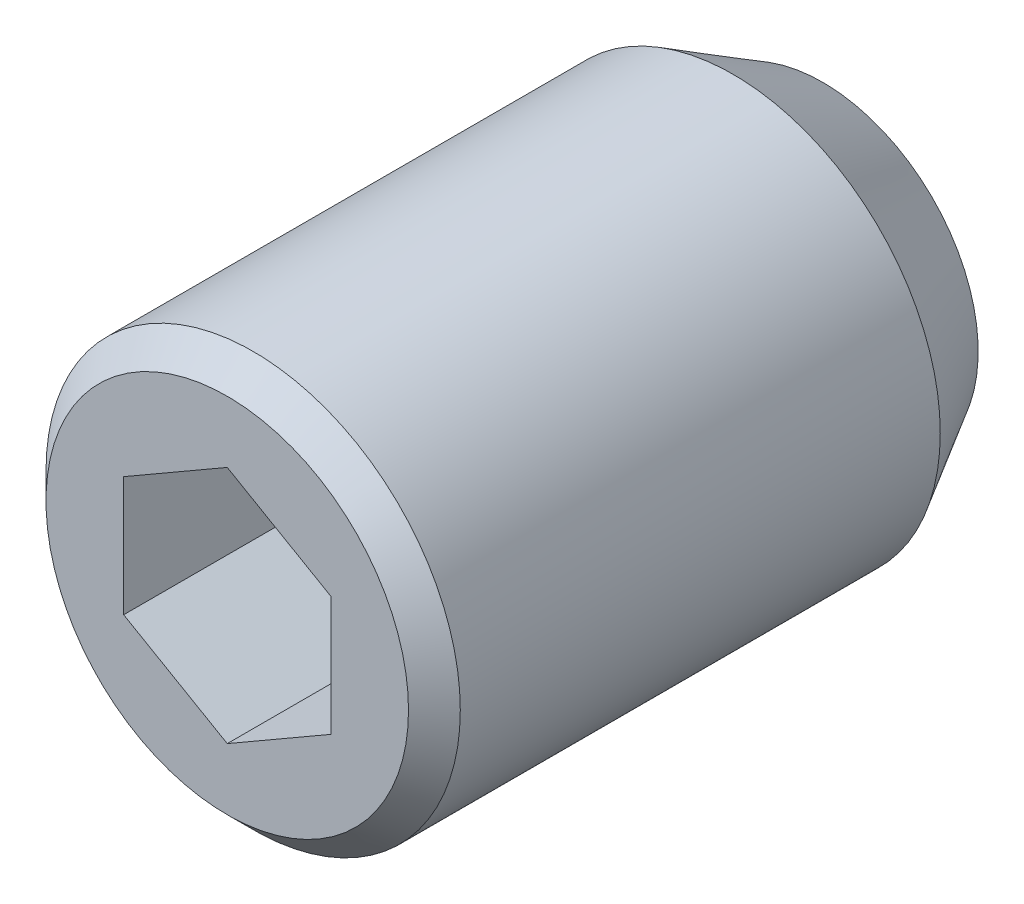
ISO-10303-21;
HEADER;
FILE_DESCRIPTION(('STEP AP214'),'2;1');
FILE_NAME('part.step','',(''),(''),'','','');
FILE_SCHEMA(('AUTOMOTIVE_DESIGN { 1 0 10303 214 1 1 1 1 }'));
ENDSEC;
DATA;
#1=APPLICATION_CONTEXT('core data for automotive mechanical design processes');
#2=APPLICATION_PROTOCOL_DEFINITION('international standard','automotive_design',2000,#1);
#3=PRODUCT_CONTEXT('',#1,'mechanical');
#4=PRODUCT('Part','Part','',(#3));
#5=PRODUCT_RELATED_PRODUCT_CATEGORY('part','',(#4));
#6=PRODUCT_DEFINITION_FORMATION('','',#4);
#7=PRODUCT_DEFINITION_CONTEXT('part definition',#1,'design');
#8=PRODUCT_DEFINITION('design','',#6,#7);
#9=PRODUCT_DEFINITION_SHAPE('','',#8);
#10=(LENGTH_UNIT() NAMED_UNIT(*) SI_UNIT(.MILLI.,.METRE.));
#11=(NAMED_UNIT(*) PLANE_ANGLE_UNIT() SI_UNIT($,.RADIAN.));
#12=(NAMED_UNIT(*) SI_UNIT($,.STERADIAN.) SOLID_ANGLE_UNIT());
#13=UNCERTAINTY_MEASURE_WITH_UNIT(LENGTH_MEASURE(1.E-05),#10,'distance_accuracy_value','');
#14=(GEOMETRIC_REPRESENTATION_CONTEXT(3) GLOBAL_UNCERTAINTY_ASSIGNED_CONTEXT((#13)) GLOBAL_UNIT_ASSIGNED_CONTEXT((#10,
#11,#12)) REPRESENTATION_CONTEXT('',''));
#15=CARTESIAN_POINT('',(0.,0.,0.));
#16=DIRECTION('',(0.,0.,1.));
#17=DIRECTION('',(1.,0.,0.));
#18=AXIS2_PLACEMENT_3D('',#15,#16,#17);
#19=CARTESIAN_POINT('',(1.,0.577350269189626,4.));
#20=DIRECTION('',(0.5,0.866025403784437,0.));
#21=DIRECTION('',(0.866025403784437,-0.5,0.));
#22=AXIS2_PLACEMENT_3D('',#19,#20,#21);
#23=PLANE('',#22);
#24=DIRECTION('',(0.,0.,1.));
#25=VECTOR('',#24,1.);
#26=CARTESIAN_POINT('',(1.,0.577350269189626,4.));
#27=LINE('',#26,#25);
#28=CARTESIAN_POINT('',(1.,0.577350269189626,4.));
#29=VERTEX_POINT('',#28);
#30=CARTESIAN_POINT('',(1.,0.577350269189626,6.));
#31=VERTEX_POINT('',#30);
#32=EDGE_CURVE('E96',#29,#31,#27,.T.);
#33=ORIENTED_EDGE('',*,*,#32,.T.);
#34=DIRECTION('',(-0.866025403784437,0.5,0.));
#35=VECTOR('',#34,1.);
#36=CARTESIAN_POINT('',(1.,0.577350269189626,6.));
#37=LINE('',#36,#35);
#38=CARTESIAN_POINT('',(0.,1.15470053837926,6.));
#39=VERTEX_POINT('',#38);
#40=EDGE_CURVE('E29',#31,#39,#37,.T.);
#41=ORIENTED_EDGE('',*,*,#40,.T.);
#42=DIRECTION('',(0.,0.,1.));
#43=VECTOR('',#42,1.);
#44=CARTESIAN_POINT('',(0.,1.15470053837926,4.));
#45=LINE('',#44,#43);
#46=CARTESIAN_POINT('',(0.,1.15470053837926,4.));
#47=VERTEX_POINT('',#46);
#48=EDGE_CURVE('E34',#47,#39,#45,.T.);
#49=ORIENTED_EDGE('',*,*,#48,.F.);
#50=DIRECTION('',(-0.866025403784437,0.5,0.));
#51=VECTOR('',#50,1.);
#52=CARTESIAN_POINT('',(1.,0.577350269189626,4.));
#53=LINE('',#52,#51);
#54=EDGE_CURVE('E90',#29,#47,#53,.T.);
#55=ORIENTED_EDGE('',*,*,#54,.F.);
#56=EDGE_LOOP('',(#33,#41,#49,#55));
#57=FACE_BOUND('',#56,.T.);
#58=ADVANCED_FACE('F14',(#57),#23,.F.);
#59=CARTESIAN_POINT('',(1.,-0.577350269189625,4.));
#60=DIRECTION('',(1.,0.,0.));
#61=DIRECTION('',(0.,-1.,0.));
#62=AXIS2_PLACEMENT_3D('',#59,#60,#61);
#63=PLANE('',#62);
#64=DIRECTION('',(0.,0.,1.));
#65=VECTOR('',#64,1.);
#66=CARTESIAN_POINT('',(1.,-0.577350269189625,4.));
#67=LINE('',#66,#65);
#68=CARTESIAN_POINT('',(1.,-0.577350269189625,4.));
#69=VERTEX_POINT('',#68);
#70=CARTESIAN_POINT('',(1.,-0.577350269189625,6.));
#71=VERTEX_POINT('',#70);
#72=EDGE_CURVE('E93',#69,#71,#67,.T.);
#73=ORIENTED_EDGE('',*,*,#72,.T.);
#74=DIRECTION('',(0.,1.,0.));
#75=VECTOR('',#74,1.);
#76=CARTESIAN_POINT('',(1.,-0.577350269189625,6.));
#77=LINE('',#76,#75);
#78=EDGE_CURVE('E117',#71,#31,#77,.T.);
#79=ORIENTED_EDGE('',*,*,#78,.T.);
#80=ORIENTED_EDGE('',*,*,#32,.F.);
#81=DIRECTION('',(0.,1.,0.));
#82=VECTOR('',#81,1.);
#83=CARTESIAN_POINT('',(1.,-0.577350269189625,4.));
#84=LINE('',#83,#82);
#85=EDGE_CURVE('E85',#69,#29,#84,.T.);
#86=ORIENTED_EDGE('',*,*,#85,.F.);
#87=EDGE_LOOP('',(#73,#79,#80,#86));
#88=FACE_BOUND('',#87,.T.);
#89=ADVANCED_FACE('F149',(#88),#63,.F.);
#90=CARTESIAN_POINT('',(1.,-0.577350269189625,4.));
#91=DIRECTION('',(-0.5,0.866025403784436,0.));
#92=DIRECTION('',(0.866025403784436,0.5,0.));
#93=AXIS2_PLACEMENT_3D('',#90,#91,#92);
#94=PLANE('',#93);
#95=DIRECTION('',(0.,0.,1.));
#96=VECTOR('',#95,1.);
#97=CARTESIAN_POINT('',(0.,-1.15470053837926,4.));
#98=LINE('',#97,#96);
#99=CARTESIAN_POINT('',(0.,-1.15470053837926,4.));
#100=VERTEX_POINT('',#99);
#101=CARTESIAN_POINT('',(0.,-1.15470053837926,6.));
#102=VERTEX_POINT('',#101);
#103=EDGE_CURVE('E68',#100,#102,#98,.T.);
#104=ORIENTED_EDGE('',*,*,#103,.T.);
#105=DIRECTION('',(-0.866025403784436,-0.5,0.));
#106=VECTOR('',#105,1.);
#107=CARTESIAN_POINT('',(1.,-0.577350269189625,6.));
#108=LINE('',#107,#106);
#109=EDGE_CURVE('E121',#71,#102,#108,.T.);
#110=ORIENTED_EDGE('',*,*,#109,.F.);
#111=ORIENTED_EDGE('',*,*,#72,.F.);
#112=DIRECTION('',(-0.866025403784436,-0.5,0.));
#113=VECTOR('',#112,1.);
#114=CARTESIAN_POINT('',(1.,-0.577350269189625,4.));
#115=LINE('',#114,#113);
#116=EDGE_CURVE('E83',#69,#100,#115,.T.);
#117=ORIENTED_EDGE('',*,*,#116,.T.);
#118=EDGE_LOOP('',(#104,#110,#111,#117));
#119=FACE_BOUND('',#118,.T.);
#120=ADVANCED_FACE('F155',(#119),#94,.T.);
#121=CARTESIAN_POINT('',(-1.,-0.577350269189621,4.));
#122=DIRECTION('',(-0.5,-0.866025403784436,0.));
#123=DIRECTION('',(-0.866025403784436,0.5,0.));
#124=AXIS2_PLACEMENT_3D('',#121,#122,#123);
#125=PLANE('',#124);
#126=DIRECTION('',(0.,0.,1.));
#127=VECTOR('',#126,1.);
#128=CARTESIAN_POINT('',(-1.,-0.577350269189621,4.));
#129=LINE('',#128,#127);
#130=CARTESIAN_POINT('',(-1.,-0.577350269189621,4.));
#131=VERTEX_POINT('',#130);
#132=CARTESIAN_POINT('',(-1.,-0.577350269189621,6.));
#133=VERTEX_POINT('',#132);
#134=EDGE_CURVE('E56',#131,#133,#129,.T.);
#135=ORIENTED_EDGE('',*,*,#134,.T.);
#136=DIRECTION('',(0.866025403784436,-0.5,0.));
#137=VECTOR('',#136,1.);
#138=CARTESIAN_POINT('',(-1.,-0.577350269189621,6.));
#139=LINE('',#138,#137);
#140=EDGE_CURVE('E130',#133,#102,#139,.T.);
#141=ORIENTED_EDGE('',*,*,#140,.T.);
#142=ORIENTED_EDGE('',*,*,#103,.F.);
#143=DIRECTION('',(0.866025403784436,-0.5,0.));
#144=VECTOR('',#143,1.);
#145=CARTESIAN_POINT('',(-1.,-0.577350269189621,4.));
#146=LINE('',#145,#144);
#147=EDGE_CURVE('E76',#131,#100,#146,.T.);
#148=ORIENTED_EDGE('',*,*,#147,.F.);
#149=EDGE_LOOP('',(#135,#141,#142,#148));
#150=FACE_BOUND('',#149,.T.);
#151=ADVANCED_FACE('F81',(#150),#125,.F.);
#152=CARTESIAN_POINT('',(-1.,-0.577350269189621,4.));
#153=DIRECTION('',(1.,0.,0.));
#154=DIRECTION('',(0.,-1.,0.));
#155=AXIS2_PLACEMENT_3D('',#152,#153,#154);
#156=PLANE('',#155);
#157=DIRECTION('',(0.,0.,1.));
#158=VECTOR('',#157,1.);
#159=CARTESIAN_POINT('',(-1.,0.577350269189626,4.));
#160=LINE('',#159,#158);
#161=CARTESIAN_POINT('',(-1.,0.577350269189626,4.));
#162=VERTEX_POINT('',#161);
#163=CARTESIAN_POINT('',(-1.,0.577350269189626,6.));
#164=VERTEX_POINT('',#163);
#165=EDGE_CURVE('E69',#162,#164,#160,.T.);
#166=ORIENTED_EDGE('',*,*,#165,.T.);
#167=DIRECTION('',(0.,1.,0.));
#168=VECTOR('',#167,1.);
#169=CARTESIAN_POINT('',(-1.,-0.577350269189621,6.));
#170=LINE('',#169,#168);
#171=EDGE_CURVE('E63',#133,#164,#170,.T.);
#172=ORIENTED_EDGE('',*,*,#171,.F.);
#173=ORIENTED_EDGE('',*,*,#134,.F.);
#174=DIRECTION('',(0.,1.,0.));
#175=VECTOR('',#174,1.);
#176=CARTESIAN_POINT('',(-1.,-0.577350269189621,4.));
#177=LINE('',#176,#175);
#178=EDGE_CURVE('E60',#131,#162,#177,.T.);
#179=ORIENTED_EDGE('',*,*,#178,.T.);
#180=EDGE_LOOP('',(#166,#172,#173,#179));
#181=FACE_BOUND('',#180,.T.);
#182=ADVANCED_FACE('F59',(#181),#156,.T.);
#183=CARTESIAN_POINT('',(-1.,0.577350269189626,4.));
#184=DIRECTION('',(0.5,-0.866025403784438,0.));
#185=DIRECTION('',(-0.866025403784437,-0.5,0.));
#186=AXIS2_PLACEMENT_3D('',#183,#184,#185);
#187=PLANE('',#186);
#188=DIRECTION('',(0.866025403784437,0.5,0.));
#189=VECTOR('',#188,1.);
#190=CARTESIAN_POINT('',(-1.,0.577350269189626,4.));
#191=LINE('',#190,#189);
#192=EDGE_CURVE('E79',#162,#47,#191,.T.);
#193=ORIENTED_EDGE('',*,*,#192,.T.);
#194=ORIENTED_EDGE('',*,*,#48,.T.);
#195=DIRECTION('',(0.866025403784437,0.5,0.));
#196=VECTOR('',#195,1.);
#197=CARTESIAN_POINT('',(-1.,0.577350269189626,6.));
#198=LINE('',#197,#196);
#199=EDGE_CURVE('E127',#164,#39,#198,.T.);
#200=ORIENTED_EDGE('',*,*,#199,.F.);
#201=ORIENTED_EDGE('',*,*,#165,.F.);
#202=EDGE_LOOP('',(#193,#194,#200,#201));
#203=FACE_BOUND('',#202,.T.);
#204=ADVANCED_FACE('F137',(#203),#187,.T.);
#205=CARTESIAN_POINT('',(2.,0.,4.));
#206=DIRECTION('',(0.,0.,1.));
#207=DIRECTION('',(-1.,0.,0.));
#208=AXIS2_PLACEMENT_3D('',#205,#206,#207);
#209=PLANE('',#208);
#210=ORIENTED_EDGE('',*,*,#54,.T.);
#211=ORIENTED_EDGE('',*,*,#192,.F.);
#212=ORIENTED_EDGE('',*,*,#178,.F.);
#213=ORIENTED_EDGE('',*,*,#147,.T.);
#214=ORIENTED_EDGE('',*,*,#116,.F.);
#215=ORIENTED_EDGE('',*,*,#85,.T.);
#216=EDGE_LOOP('',(#210,#211,#212,#213,#214,#215));
#217=FACE_BOUND('',#216,.T.);
#218=ADVANCED_FACE('F74',(#217),#209,.T.);
#219=CARTESIAN_POINT('',(0.,0.,5.75));
#220=DIRECTION('',(0.,0.,-1.));
#221=DIRECTION('',(1.,0.,0.));
#222=AXIS2_PLACEMENT_3D('',#219,#220,#221);
#223=CYLINDRICAL_SURFACE('',#222,2.);
#224=CARTESIAN_POINT('',(0.,0.,5.75));
#225=DIRECTION('',(0.,0.,-1.));
#226=DIRECTION('',(1.,0.,0.));
#227=AXIS2_PLACEMENT_3D('',#224,#225,#226);
#228=CIRCLE('',#227,2.);
#229=CARTESIAN_POINT('',(2.,0.,5.75));
#230=VERTEX_POINT('',#229);
#231=EDGE_CURVE('E101',#230,#230,#228,.T.);
#232=ORIENTED_EDGE('',*,*,#231,.T.);
#233=EDGE_LOOP('',(#232));
#234=FACE_BOUND('',#233,.T.);
#235=CARTESIAN_POINT('',(0.,0.,1.11602540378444));
#236=DIRECTION('',(0.,0.,-1.));
#237=DIRECTION('',(-1.,0.,0.));
#238=AXIS2_PLACEMENT_3D('',#235,#236,#237);
#239=CIRCLE('',#238,2.);
#240=CARTESIAN_POINT('',(-2.,0.,1.11602540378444));
#241=VERTEX_POINT('',#240);
#242=EDGE_CURVE('E118',#241,#241,#239,.T.);
#243=ORIENTED_EDGE('',*,*,#242,.F.);
#244=EDGE_LOOP('',(#243));
#245=FACE_BOUND('',#244,.T.);
#246=ADVANCED_FACE('F174',(#234,#245),#223,.T.);
#247=CARTESIAN_POINT('',(0.,0.,5.75));
#248=DIRECTION('',(0.,0.,-1.));
#249=DIRECTION('',(1.,0.,0.));
#250=AXIS2_PLACEMENT_3D('',#247,#248,#249);
#251=CONICAL_SURFACE('',#250,2.,0.785398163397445);
#252=CARTESIAN_POINT('',(0.,0.,6.));
#253=DIRECTION('',(0.,0.,-1.));
#254=DIRECTION('',(1.,0.,0.));
#255=AXIS2_PLACEMENT_3D('',#252,#253,#254);
#256=CIRCLE('',#255,1.75);
#257=CARTESIAN_POINT('',(1.75,0.,6.));
#258=VERTEX_POINT('',#257);
#259=EDGE_CURVE('E98',#258,#258,#256,.T.);
#260=ORIENTED_EDGE('',*,*,#259,.T.);
#261=EDGE_LOOP('',(#260));
#262=FACE_BOUND('',#261,.T.);
#263=ORIENTED_EDGE('',*,*,#231,.F.);
#264=EDGE_LOOP('',(#263));
#265=FACE_BOUND('',#264,.T.);
#266=ADVANCED_FACE('F182',(#262,#265),#251,.T.);
#267=CARTESIAN_POINT('',(0.,0.,6.));
#268=DIRECTION('',(0.,0.,-1.));
#269=DIRECTION('',(1.,0.,0.));
#270=AXIS2_PLACEMENT_3D('',#267,#268,#269);
#271=PLANE('',#270);
#272=ORIENTED_EDGE('',*,*,#199,.T.);
#273=ORIENTED_EDGE('',*,*,#40,.F.);
#274=ORIENTED_EDGE('',*,*,#78,.F.);
#275=ORIENTED_EDGE('',*,*,#109,.T.);
#276=ORIENTED_EDGE('',*,*,#140,.F.);
#277=ORIENTED_EDGE('',*,*,#171,.T.);
#278=EDGE_LOOP('',(#272,#273,#274,#275,#276,#277));
#279=FACE_BOUND('',#278,.T.);
#280=ORIENTED_EDGE('',*,*,#259,.F.);
#281=EDGE_LOOP('',(#280));
#282=FACE_BOUND('',#281,.T.);
#283=ADVANCED_FACE('F152',(#279,#282),#271,.F.);
#284=CARTESIAN_POINT('',(0.,0.,0.25));
#285=DIRECTION('',(0.,0.,1.));
#286=DIRECTION('',(1.,0.,0.));
#287=AXIS2_PLACEMENT_3D('',#284,#285,#286);
#288=CONICAL_SURFACE('',#287,1.5,0.523598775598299);
#289=ORIENTED_EDGE('',*,*,#242,.T.);
#290=EDGE_LOOP('',(#289));
#291=FACE_BOUND('',#290,.T.);
#292=CARTESIAN_POINT('',(0.,0.,0.25));
#293=DIRECTION('',(0.,0.,-1.));
#294=DIRECTION('',(-1.,0.,0.));
#295=AXIS2_PLACEMENT_3D('',#292,#293,#294);
#296=CIRCLE('',#295,1.5);
#297=CARTESIAN_POINT('',(-1.5,0.,0.25));
#298=VERTEX_POINT('',#297);
#299=EDGE_CURVE('E115',#298,#298,#296,.T.);
#300=ORIENTED_EDGE('',*,*,#299,.F.);
#301=EDGE_LOOP('',(#300));
#302=FACE_BOUND('',#301,.T.);
#303=ADVANCED_FACE('F196',(#291,#302),#288,.T.);
#304=CARTESIAN_POINT('',(0.,0.,0.));
#305=DIRECTION('',(0.,0.,-1.));
#306=DIRECTION('',(1.,0.,0.));
#307=AXIS2_PLACEMENT_3D('',#304,#305,#306);
#308=PLANE('',#307);
#309=CARTESIAN_POINT('',(0.,0.,0.));
#310=DIRECTION('',(0.,0.,-1.));
#311=DIRECTION('',(1.,0.,0.));
#312=AXIS2_PLACEMENT_3D('',#309,#310,#311);
#313=CIRCLE('',#312,1.);
#314=CARTESIAN_POINT('',(1.,0.,0.));
#315=VERTEX_POINT('',#314);
#316=EDGE_CURVE('E9',#315,#315,#313,.T.);
#317=ORIENTED_EDGE('',*,*,#316,.T.);
#318=EDGE_LOOP('',(#317));
#319=FACE_BOUND('',#318,.T.);
#320=ADVANCED_FACE('F16',(#319),#308,.T.);
#321=CARTESIAN_POINT('',(0.,0.,0.75));
#322=DIRECTION('',(0.,0.,-1.));
#323=DIRECTION('',(1.,0.,0.));
#324=AXIS2_PLACEMENT_3D('',#321,#322,#323);
#325=SPHERICAL_SURFACE('',#324,1.25);
#326=CARTESIAN_POINT('',(0.,0.,0.25));
#327=DIRECTION('',(0.,0.,-1.));
#328=DIRECTION('',(1.,0.,0.));
#329=AXIS2_PLACEMENT_3D('',#326,#327,#328);
#330=CIRCLE('',#329,1.14564392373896);
#331=CARTESIAN_POINT('',(1.14564392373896,0.,0.25));
#332=VERTEX_POINT('',#331);
#333=EDGE_CURVE('E22',#332,#332,#330,.T.);
#334=CARTESIAN_POINT('',(1.14564392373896,0.,0.25));
#335=CARTESIAN_POINT('',(1.14443567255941,0.,0.247231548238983));
#336=CARTESIAN_POINT('',(1.14321738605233,0.,0.244467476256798));
#337=CARTESIAN_POINT('',(1.14076080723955,0.,0.238948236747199));
#338=CARTESIAN_POINT('',(1.13952251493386,0.,0.236193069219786));
#339=CARTESIAN_POINT('',(1.13702598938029,0.,0.230691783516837));
#340=CARTESIAN_POINT('',(1.13576775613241,0.,0.227945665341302));
#341=CARTESIAN_POINT('',(1.13323141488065,0.,0.222462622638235));
#342=CARTESIAN_POINT('',(1.13195330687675,0.,0.219725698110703));
#343=CARTESIAN_POINT('',(1.12937728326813,0.,0.21426118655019));
#344=CARTESIAN_POINT('',(1.12807936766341,0.,0.21153359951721));
#345=CARTESIAN_POINT('',(1.12546379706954,0.,0.206087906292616));
#346=CARTESIAN_POINT('',(1.1241461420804,0.,0.203369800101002));
#347=CARTESIAN_POINT('',(1.12149116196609,0.,0.197943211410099));
#348=CARTESIAN_POINT('',(1.12015383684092,0.,0.195234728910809));
#349=CARTESIAN_POINT('',(1.11745958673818,0.,0.189827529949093));
#350=CARTESIAN_POINT('',(1.11610266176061,0.,0.187128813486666));
#351=CARTESIAN_POINT('',(1.11336928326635,0.,0.18174128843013));
#352=CARTESIAN_POINT('',(1.11199282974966,0.,0.179052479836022));
#353=CARTESIAN_POINT('',(1.10922046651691,0.,0.173684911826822));
#354=CARTESIAN_POINT('',(1.10782455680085,0.,0.171006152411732));
#355=CARTESIAN_POINT('',(1.10501335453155,0.,0.165658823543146));
#356=CARTESIAN_POINT('',(1.10359806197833,0.,0.16299025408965));
#357=CARTESIAN_POINT('',(1.10074816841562,0.,0.157663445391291));
#358=CARTESIAN_POINT('',(1.09931356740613,0.,0.155005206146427));
#359=CARTESIAN_POINT('',(1.09642513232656,0.,0.149699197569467));
#360=CARTESIAN_POINT('',(1.09497129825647,0.,0.14705142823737));
#361=CARTESIAN_POINT('',(1.09204447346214,0.,0.141766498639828));
#362=CARTESIAN_POINT('',(1.0905714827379,0.,0.139129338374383));
#363=CARTESIAN_POINT('',(1.08760642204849,0.,0.133865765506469));
#364=CARTESIAN_POINT('',(1.08611435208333,0.,0.131239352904));
#365=CARTESIAN_POINT('',(1.08311121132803,0.,0.125997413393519));
#366=CARTESIAN_POINT('',(1.0816001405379,0.,0.123381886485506));
#367=CARTESIAN_POINT('',(1.07855907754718,0.,0.118161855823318));
#368=CARTESIAN_POINT('',(1.0770290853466,0.,0.115557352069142));
#369=CARTESIAN_POINT('',(1.07395025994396,0.,0.110359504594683));
#370=CARTESIAN_POINT('',(1.07240142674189,0.,0.107766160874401));
#371=CARTESIAN_POINT('',(1.06928500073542,0.,0.102590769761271));
#372=CARTESIAN_POINT('',(1.06771740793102,0.,0.100008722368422));
#373=CARTESIAN_POINT('',(1.06456354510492,0.,0.0948560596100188));
#374=CARTESIAN_POINT('',(1.06297727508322,0.,0.0922854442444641));
#375=CARTESIAN_POINT('',(1.0597861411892,0.,0.0871557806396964));
#376=CARTESIAN_POINT('',(1.05818127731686,0.,0.0845967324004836));
#377=CARTESIAN_POINT('',(1.05495304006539,0.,0.0794903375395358));
#378=CARTESIAN_POINT('',(1.05332966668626,0.,0.0769429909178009));
#379=CARTESIAN_POINT('',(1.0500644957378,0.,0.071860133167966));
#380=CARTESIAN_POINT('',(1.04842269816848,0.,0.069324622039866));
#381=CARTESIAN_POINT('',(1.04512076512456,0.,0.0642655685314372));
#382=CARTESIAN_POINT('',(1.04346062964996,0.,0.0617420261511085));
#383=CARTESIAN_POINT('',(1.04012210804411,0.,0.0567070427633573));
#384=CARTESIAN_POINT('',(1.03844372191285,0.,0.0541956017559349));
#385=CARTESIAN_POINT('',(1.03506878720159,0.,0.0491849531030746));
#386=CARTESIAN_POINT('',(1.03337223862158,0.,0.0466857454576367));
#387=CARTESIAN_POINT('',(1.02996106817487,0.,0.0416996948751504));
#388=CARTESIAN_POINT('',(1.02824644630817,0.,0.039212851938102));
#389=CARTESIAN_POINT('',(1.02479921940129,0.,0.0342516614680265));
#390=CARTESIAN_POINT('',(1.02306661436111,0.,0.0317773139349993));
#391=CARTESIAN_POINT('',(1.01958351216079,0.,0.0268412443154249));
#392=CARTESIAN_POINT('',(1.01783301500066,0.,0.0243795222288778));
#393=CARTESIAN_POINT('',(1.01431422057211,0.,0.019468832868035));
#394=CARTESIAN_POINT('',(1.01254592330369,0.,0.0170198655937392));
#395=CARTESIAN_POINT('',(1.00899162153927,0.,0.012134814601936));
#396=CARTESIAN_POINT('',(1.00720561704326,0.,0.00969873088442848));
#397=CARTESIAN_POINT('',(1.00361599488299,0.,0.00483957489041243));
#398=CARTESIAN_POINT('',(1.00181237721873,0.,0.00241650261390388));
#399=CARTESIAN_POINT('',(1.,0.,0.));
#400=B_SPLINE_CURVE_WITH_KNOTS('',3,(#334,#335,#336,#337,#338,#339,#340,#341,#342,#343,#344,
#345,#346,#347,#348,#349,#350,#351,#352,#353,#354,#355,#356,#357,#358,#359,#360,#361,#362,#363,
#364,#365,#366,#367,#368,#369,#370,#371,#372,#373,#374,#375,#376,#377,#378,#379,#380,#381,#382,
#383,#384,#385,#386,#387,#388,#389,#390,#391,#392,#393,#394,#395,#396,#397,#398,#399),
.UNSPECIFIED.,.F.,.F.,(4,2,2,2,2,2,2,2,2,2,2,2,2,2,2,2,2,2,2,2,2,2,2,2,2,2,2,2,2,2,2,2,4),(0.,
0.00906186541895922,0.0181237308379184,0.0271855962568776,0.0362474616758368,0.045309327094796,
0.0543711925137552,0.0634330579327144,0.0724949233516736,0.0815567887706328,0.0906186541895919,
0.0996805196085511,0.10874238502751,0.11780425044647,0.126866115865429,0.135927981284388,
0.144989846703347,0.154051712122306,0.163113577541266,0.172175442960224,0.181237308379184,
0.190299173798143,0.199361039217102,0.208422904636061,0.21748477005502,0.22654663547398,
0.235608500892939,0.244670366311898,0.253732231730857,0.262794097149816,0.271855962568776,
0.280917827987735,0.289979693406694),.UNSPECIFIED.);
#401=EDGE_CURVE('BSEAM106',#332,#315,#400,.T.);
#402=ORIENTED_EDGE('',*,*,#333,.T.);
#403=ORIENTED_EDGE('',*,*,#316,.F.);
#404=ORIENTED_EDGE('',*,*,#401,.T.);
#405=ORIENTED_EDGE('',*,*,#401,.F.);
#406=EDGE_LOOP('',(#402,#404,#403,#405));
#407=FACE_BOUND('',#406,.T.);
#408=ADVANCED_FACE('F106',(#407),#325,.T.);
#409=CARTESIAN_POINT('',(1.42264973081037,0.,0.25));
#410=DIRECTION('',(0.,0.,1.));
#411=DIRECTION('',(-1.,0.,0.));
#412=AXIS2_PLACEMENT_3D('',#409,#410,#411);
#413=PLANE('',#412);
#414=ORIENTED_EDGE('',*,*,#333,.F.);
#415=EDGE_LOOP('',(#414));
#416=FACE_BOUND('',#415,.T.);
#417=ORIENTED_EDGE('',*,*,#299,.T.);
#418=EDGE_LOOP('',(#417));
#419=FACE_BOUND('',#418,.T.);
#420=ADVANCED_FACE('F109',(#416,#419),#413,.F.);
#421=CLOSED_SHELL('',(#58,#89,#120,#151,#182,#204,#218,#246,#266,#283,#303,#320,#408,#420));
#422=MANIFOLD_SOLID_BREP('B1',#421);
#423=ADVANCED_BREP_SHAPE_REPRESENTATION('',(#18,#422),#14);
#424=SHAPE_DEFINITION_REPRESENTATION(#9,#423);
ENDSEC;
END-ISO-10303-21;
